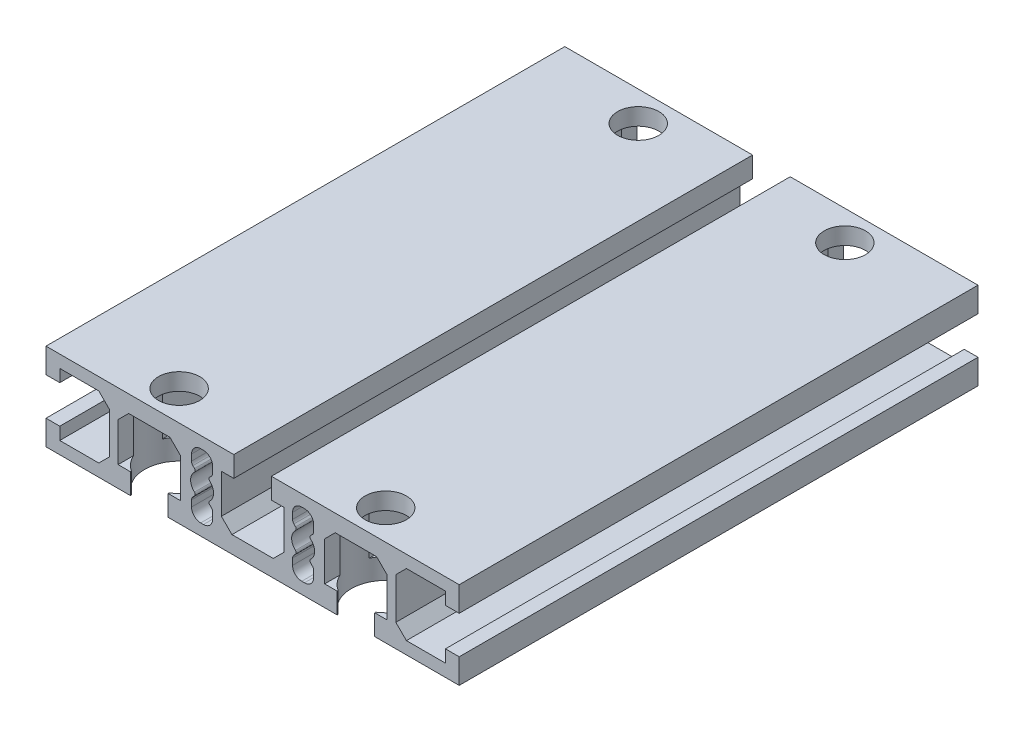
from build123d import *

# Parameters (mm, degrees)
BOSS_EXTRUDE1_DEPTH                     = 56.5
BOSS_EXTRUDE1_DEPTH_BACK                = 56.5
CBORE_FOR_M8_HEX_HEAD_BOLT1_D           = 9
CBORE_FOR_M8_HEX_HEAD_BOLT1_CBORE_D     = 15
CBORE_FOR_M8_HEX_HEAD_BOLT1_CBORE_DEPTH = 15.3


with BuildPart() as part:
    # Sketch1 → Boss-Extrude1 (new, two sides: drawn at the far end of the back side and taken through both)
    with BuildSketch(Plane.XY.offset(-BOSS_EXTRUDE1_DEPTH_BACK)):
        Polygon((-15.7, 3.5), (-15.7, -5), (-18.4, -5), (-18.4, -9.5), (18.4, -9.5), (18.4, -5), (15.7, -5), (15.7, 3.5), (18, 5.8), (27, 5.8), (29.3, 3.5), (29.3, -5), (26.6, -5), (26.6, -9.5), (45, -9.5), (45, -4.1), (42, -4.1), (42, -6.8), (33.5, -6.8), (31.2, -4.5), (31.2, 4.5), (33.5, 6.8), (42, 6.8), (42, 4.1), (45, 4.1), (45, 9.5), (4.1, 9.5), (4.1, 5), (6.8, 5), (6.8, -3.5), (4.5, -5.8), (-4.5, -5.8), (-6.8, -3.5), (-6.8, 5), (-4.1, 5), (-4.1, 9.5), (-45, 9.5), (-45, 4.1), (-42, 4.1), (-42, 6.8), (-33.5, 6.8), (-31.2, 4.5), (-31.2, -4.5), (-33.5, -6.8), (-42, -6.8), (-42, -4.1), (-45, -4.1), (-45, -9.5), (-26.6, -9.5), (-26.6, -5), (-29.3, -5), (-29.3, 3.5), (-27, 5.8), (-18, 5.8), align=None)
        with BuildLine():
            Line((-13.299970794, -4.999975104), (-13.299970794, -3.657373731))
            ThreePointArc((-13.299970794, -3.657373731), (-13.223850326, -3.274690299), (-13.007077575, -2.95026695))
            Line((-13.007077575, -2.95026695), (-12.646417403, -2.589606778))
            ThreePointArc((-12.646417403, -2.589606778), (-12.500164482, -2.222137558), (-12.66663746, -1.863375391))
            ThreePointArc((-12.66663746, -1.863375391), (-13.499970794, 1.459e-05), (-12.66663746, 1.863404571))
            ThreePointArc((-12.66663746, 1.863404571), (-12.500164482, 2.222166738), (-12.646417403, 2.589635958))
            Line((-12.646417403, 2.589635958), (-13.007077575, 2.95029613))
            ThreePointArc((-13.007077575, 2.95029613), (-13.223850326, 3.274719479), (-13.299970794, 3.657402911))
            Line((-13.299970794, 3.657402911), (-13.299970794, 5.000004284))
            ThreePointArc((-13.299970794, 5.000004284), (-12.714184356, 6.414217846), (-11.299970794, 7.000004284))
            Line((-11.299970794, 7.000004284), (-10.699970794, 7.000004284))
            ThreePointArc((-10.699970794, 7.000004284), (-9.285757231, 6.414217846), (-8.699970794, 5.000004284))
            Line((-8.699970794, 5.000004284), (-8.699970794, 3.657402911))
            ThreePointArc((-8.699970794, 3.657402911), (-8.776091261, 3.274719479), (-8.992864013, 2.95029613))
            Line((-8.992864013, 2.95029613), (-9.353524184, 2.589635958))
            ThreePointArc((-9.353524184, 2.589635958), (-9.499777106, 2.222166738), (-9.333304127, 1.863404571))
            ThreePointArc((-9.333304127, 1.863404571), (-8.499970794, 1.459e-05), (-9.333304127, -1.863375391))
            ThreePointArc((-9.333304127, -1.863375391), (-9.499777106, -2.222137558), (-9.353524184, -2.589606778))
            Line((-9.353524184, -2.589606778), (-8.992864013, -2.95026695))
            ThreePointArc((-8.992864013, -2.95026695), (-8.776091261, -3.274690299), (-8.699970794, -3.657373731))
            Line((-8.699970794, -3.657373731), (-8.699970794, -4.999975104))
            ThreePointArc((-8.699970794, -4.999975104), (-9.285757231, -6.414188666), (-10.699970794, -6.999975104))
            Line((-10.699970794, -6.999975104), (-11.299970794, -6.999975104))
            ThreePointArc((-11.299970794, -6.999975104), (-12.714184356, -6.414188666), (-13.299970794, -4.999975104))
        make_face(mode=Mode.SUBTRACT)
        with BuildLine():
            Line((13.007077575, 2.95029613), (12.646417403, 2.589635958))
            ThreePointArc((12.646417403, 2.589635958), (12.500164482, 2.222166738), (12.66663746, 1.863404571))
            ThreePointArc((12.66663746, 1.863404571), (13.499970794, 1.459e-05), (12.66663746, -1.863375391))
            ThreePointArc((12.66663746, -1.863375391), (12.500164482, -2.222137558), (12.646417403, -2.589606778))
            Line((12.646417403, -2.589606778), (13.007077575, -2.95026695))
            ThreePointArc((13.007077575, -2.95026695), (13.223850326, -3.274690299), (13.299970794, -3.657373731))
            Line((13.299970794, -3.657373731), (13.299970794, -4.999975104))
            ThreePointArc((13.299970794, -4.999975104), (12.714184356, -6.414188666), (11.299970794, -6.999975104))
            Line((11.299970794, -6.999975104), (10.699970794, -6.999975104))
            ThreePointArc((10.699970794, -6.999975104), (9.285757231, -6.414188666), (8.699970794, -4.999975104))
            Line((8.699970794, -4.999975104), (8.699970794, -3.657373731))
            ThreePointArc((8.699970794, -3.657373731), (8.776091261, -3.274690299), (8.992864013, -2.95026695))
            Line((8.992864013, -2.95026695), (9.353524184, -2.589606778))
            ThreePointArc((9.353524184, -2.589606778), (9.499777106, -2.222137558), (9.333304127, -1.863375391))
            ThreePointArc((9.333304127, -1.863375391), (8.499970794, 1.459e-05), (9.333304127, 1.863404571))
            ThreePointArc((9.333304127, 1.863404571), (9.499777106, 2.222166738), (9.353524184, 2.589635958))
            Line((9.353524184, 2.589635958), (8.992864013, 2.95029613))
            ThreePointArc((8.992864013, 2.95029613), (8.776091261, 3.274719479), (8.699970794, 3.657402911))
            Line((8.699970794, 3.657402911), (8.699970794, 5.000004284))
            ThreePointArc((8.699970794, 5.000004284), (9.285757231, 6.414217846), (10.699970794, 7.000004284))
            Line((10.699970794, 7.000004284), (11.299970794, 7.000004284))
            ThreePointArc((11.299970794, 7.000004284), (12.714184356, 6.414217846), (13.299970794, 5.000004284))
            Line((13.299970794, 5.000004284), (13.299970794, 3.657402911))
            ThreePointArc((13.299970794, 3.657402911), (13.223850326, 3.274719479), (13.007077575, 2.95029613))
        make_face(mode=Mode.SUBTRACT)
    extrude(amount=BOSS_EXTRUDE1_DEPTH + BOSS_EXTRUDE1_DEPTH_BACK)

    # CBORE for M8 Hex Head Bolt1 (through all)
    with Locations(Plane.XZ.offset(9.5)):
        with Locations((-22.5, 50), (-22.5, -50), (22.5, -50), (22.5, 50)):
            CounterBoreHole(CBORE_FOR_M8_HEX_HEAD_BOLT1_D / 2, CBORE_FOR_M8_HEX_HEAD_BOLT1_CBORE_D / 2, CBORE_FOR_M8_HEX_HEAD_BOLT1_CBORE_DEPTH)


solid = part.part
